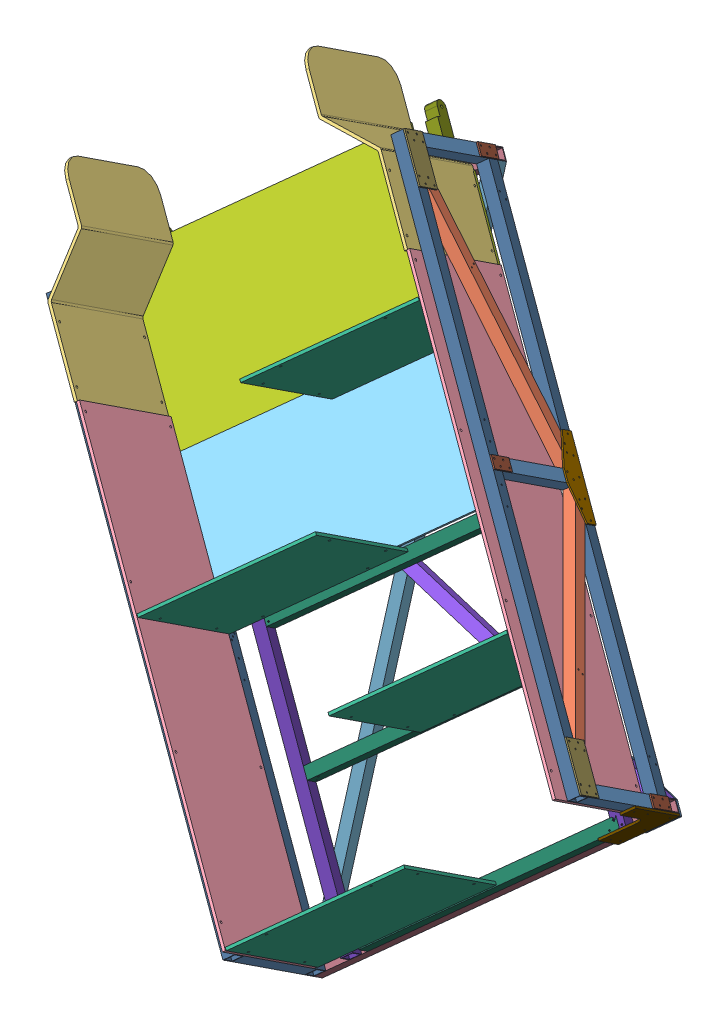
SolidWorks assembly FOCE Flue  Wing Assembly- JS.SLDASM, configuration Default (file format 3800). Lengths in mm.
Overall size (2968.73 2794.38 2015.12).
51 component instances, 22 part files, 117 mates.
Components (placement in the parent):
- UHMW Clevis-6: UHMW Clevis.SLDPRT [Default] at (1142.5369 -133.8955 -970.6957) x (0 0 -1) z (-1 0 0) (suppressed, hidden)
- UHMW Clevis-7: UHMW Clevis.SLDPRT [Default] at (1142.5369 -133.8955 -2097.6937) x (0 0 -1) z (-0.999767 0.02158 0) (suppressed, hidden)
- FRP 16.5 x  2in x 2in-1: FRP 16.5 x  2in x 2in.SLDPRT [Default] at (1659.5307 -2544.8351 -1318.5893) x (0.030538 0.555686 0.830831) z (0.716672 -0.591588 0.36933) size (419.1 50.8 50.8)
- FRP 16.5 x  2in x 2in-2: FRP 16.5 x  2in x 2in.SLDPRT [Default] at (840.3743 -1868.6503 -1740.7335) x (0.030538 0.555686 0.830831) z (0.716672 -0.591588 0.36933) size (419.1 50.8 50.8)
- FRP 16.5 x  2in x 2in-3: FRP 16.5 x  2in x 2in.SLDPRT [Default] at (21.2179 -1192.4654 -2162.8777) x (0.030538 0.555686 0.830831) z (0.716672 -0.591588 0.36933) size (419.1 50.8 50.8)
- FRP Diagonal 46.06 in-1: FRP Diagonal 46.06 in.SLDPRT [Default] at (-1214.1594 446.1713 -1809.1036) x (0.645281 -0.763903 0.008061) z (-0.696741 -0.584155 0.416311) size (1169.85 50.8 50.8)
- FRP Diagonal 46.06 in-3: FRP Diagonal 46.06 in.SLDPRT [Default] at (1902.4778 -3716.5861 860.5212) x (-0.669595 0.321481 -0.669547) z (0.696741 0.584155 -0.416311) size (1169.85 50.8 50.8)
- FRP Diagonal 46.06 in-4: FRP Diagonal 46.06 in.SLDPRT [Default] at (-2204.3654 -385.5671 -1216.713) x (0.645281 -0.763903 0.008061) z (-0.696741 -0.584155 0.416311) size (1169.85 50.8 50.8)
- flume side, joint-1: flume side, joint.SLDPRT [Default] at (251.2644 -1138.1194 -1559.5597) x (-0.716672 0.591588 -0.36933) z (0.696741 0.584155 -0.416311) size (795.53 525.78 198.63)
- flume side, joint-2: flume side, joint.SLDPRT [Default] at (-720.2957 -2228.8512 -1421.3998) x (-0.716672 0.591588 -0.36933) z (-0.696741 -0.584155 0.416311) size (795.53 525.78 198.63)
- test flume-1: test flume.SLDPRT [Default] at (1118.7791 354.4109 -2099.4399) x (-0.999767 0.02158 0) z (0 0 -1) (suppressed, hidden)
- flume side-1: flume side.SLDPRT [Default] at (677.8267 -3358.5627 -717.2036) x (0.696741 0.584155 -0.416311) z (0.716672 -0.591588 0.36933) size (12.7 525.78 1930.4)
- flume top OB-1: flume top OB.SLDPRT [Default] at (750.7573 -1846.1891 -1737.1763) x (-0.696741 -0.584155 0.416311) z (-0.716672 0.591588 -0.36933) (suppressed, hidden)
- flume mid-top -1: flume mid-top .SLDPRT [Default] at (322.8741 -1499.8684 -1947.3091) x (-0.696741 -0.584155 0.416311) z (-0.716672 0.591588 -0.36933) size (1371.6 12.7 608.33)
- flume baffle-1: flume baffle.SLDPRT [Default] at (-162.5392 -1958.1667 -1622.943) x (0.696741 0.584155 -0.416311) z (-0.030538 -0.555686 -0.830831) size (736.6 12.7 525.78)
- flume baffle-2: flume baffle.SLDPRT [Default] at (360.5228 -1940.0682 -1027.2073) x (-0.696741 -0.584155 0.416311) z (0.030538 0.555686 0.830831) size (736.6 12.7 525.78)
- flume baffle-3: flume baffle.SLDPRT [Default] at (1204.0684 -1926.8975 -1061.2522) x (-0.696741 -0.584155 0.416311) z (0.030538 0.555686 0.830831) size (736.6 12.7 525.78)
- flume baffle-4: flume baffle.SLDPRT [Default] at (668.5786 -3353.7131 -725.8765) x (0.696741 0.584155 -0.416311) z (-0.030538 -0.555686 -0.830831) size (736.6 12.7 525.78)
- flume top InB-1: flume top InB.SLDPRT [Default] at (322.8741 -1499.8684 -1947.3091) x (-0.716672 0.591588 -0.36933) z (0.696741 0.584155 -0.416311) size (698.5 12.7 1371.6)
- flume side-2: flume side.SLDPRT [Default] at (1631.6896 -2282.6684 -844.7892) x (-0.696741 -0.584155 0.416311) z (0.716672 -0.591588 0.36933) size (12.7 525.78 1930.4)
- Diagonal FRP 105.3945-1: Diagonal FRP 105.3945.SLDPRT [Default] at (1620.4348 -2571.5816 -1421.5505) x (-0.206066 -0.809863 0.549235) z (-0.978062 0.187978 -0.089776) size (50.8 50.8 2677.02)
- FRP Diagonal 46.06 in-6: FRP Diagonal 46.06 in.SLDPRT [Default] at (2894.3687 -2886.3824 268.7971) x (-0.669595 0.321481 -0.669547) z (0.696741 0.584155 -0.416311) size (1169.85 50.8 50.8)
- Wing Diagonal FRP Stiffening Plate-1: Wing Diagonal FRP Stiffening Plate.SLDPRT [Default] at (-187.9719 -2757.4351 -1170.1964) x (0.043884 0.544568 0.837568) z (0.715979 -0.601837 0.353788) size (101.6 6.35 330.2)
- FRP 16.5 x  2in x 2in-7: FRP 16.5 x  2in x 2in.SLDPRT [Default] at (-992.4302 -1820.2925 -1201.5731) x (-0.030538 -0.555686 -0.830831) z (0.716672 -0.591588 0.36933) size (419.1 50.8 50.8)
- FRP 16.5 x  2in x 2in-8: FRP 16.5 x  2in x 2in.SLDPRT [Default] at (-172.4275 -2497.1759 -778.9928) x (-0.030538 -0.555686 -0.830831) z (0.716672 -0.591588 0.36933) size (419.1 50.8 50.8)
- FRP 16.5 x  2in x 2in-10: FRP 16.5 x  2in x 2in.SLDPRT [Default] at (645.8903 -3172.5246 -357.079) x (-0.030538 -0.555686 -0.830831) z (0.716672 -0.591588 0.36933) size (419.1 50.8 50.8)
- FRP 92 x  2in x 2in -5: FRP 92 x  2in x 2in .SLDPRT [Default] at (1636.9349 -2341.6223 -949.2392) x (-0.716672 0.591588 -0.36933) z (-0.030538 -0.555686 -0.830831) size (2336.8 50.8 50.8)
- FRP 92 x  2in x 2in -6: FRP 92 x  2in x 2in .SLDPRT [Default] at (682.8285 -3114.7583 -336.2271) x (-0.716672 0.591588 -0.36933) z (0.030538 0.555686 0.830831) size (2336.8 50.8 50.8)
- FRP 92 x  2in x 2in -7: FRP 92 x  2in x 2in .SLDPRT [Default] at (668.4861 -3375.7374 -726.429) x (-0.716672 0.591588 -0.36933) z (0.030538 0.555686 0.830831) size (2336.8 50.8 50.8)
- FRP 92 x  2in x 2in -8: FRP 92 x  2in x 2in .SLDPRT [Default] at (-50.5836 -1192.0878 -2160.4911) x (0.716672 -0.591588 0.36933) z (0.030538 0.555686 0.830831) size (2336.8 50.8 50.8)
- Wing Diagonal FRP Stiffening Plate-2: Wing Diagonal FRP Stiffening Plate.SLDPRT [Default] at (802.4152 -1866.8258 -1801.7021) x (0.030538 0.555686 0.830831) z (-0.716672 0.591588 -0.36933) size (101.6 6.35 330.2)
- 2 in x 4 in  x .25 in FRP Stiffening Plate-1: 2 in x 4 in  x .25 in FRP Stiffening Plate.SLDPRT [Default] at (-9.2135 -1130.4745 -2142.077) x (-0.030538 -0.555686 -0.830831) z (-0.716672 0.591588 -0.36933) size (101.6 6.35 50.8) (hidden)
- 2 in x 6 in  x .25 in FRP WING Stiffening Plate-2: 2 in x 6 in  x .25 in FRP WING Stiffening Plate.SLDPRT [Default] at (-0.8392 -901.296 -1791.232) x (0.716672 -0.591588 0.36933) z (0.030538 0.555686 0.830831) size (203.2 6.35 101.6)
- 2 in x 6 in  x .25 in FRP WING Stiffening Plate-3: 2 in x 6 in  x .25 in FRP WING Stiffening Plate.SLDPRT [Default] at (1528.2529 -2163.5078 -1003.2294) x (0.716672 -0.591588 0.36933) z (0.030538 0.555686 0.830831) size (203.2 6.35 101.6)
- 2 in x 4 in  x .25 in FRP Stiffening Plate-3: 2 in x 4 in  x .25 in FRP Stiffening Plate.SLDPRT [Default] at (822.7416 -1573.7715 -1371.7313) x (-0.030538 -0.555686 -0.830831) z (-0.716672 0.591588 -0.36933) size (101.6 6.35 50.8)
- 2 in x 4 in  x .25 in FRP Stiffening Plate-4: 2 in x 4 in  x .25 in FRP Stiffening Plate.SLDPRT [Default] at (1629.0994 -2482.8442 -1297.7886) x (-0.030538 -0.555686 -0.830831) z (-0.716672 0.591588 -0.36933) size (101.6 6.35 50.8)
- FRP 58 x  2in x 2in-7: FRP 58 x  2in x 2in.SLDPRT [Default] at (1620.0211 -2571.2401 -1421.7637) x (-0.696741 -0.584155 0.416311) z (-0.716672 0.591588 -0.36933) size (1473.2 50.8 50.8)
- FRP 58 x  2in x 2in-8: FRP 58 x  2in x 2in.SLDPRT [Default] at (-18.2918 -1218.8704 -2266.0521) x (-0.696741 -0.584155 0.416311) z (-0.716672 0.591588 -0.36933) size (1473.2 50.8 50.8)
- Short Diagonal FRP for 105.3945-1: Short Diagonal FRP for 105.3945.SLDPRT [Default] at (595.1334 -3403.5887 -766.2487) x (0.971862 0.177725 -0.15459) z (-0.233562 0.812174 -0.534623) size (50.8 50.8 1322.11)
- Short Diagonal FRP for 105.3945-3: Short Diagonal FRP for 105.3945.SLDPRT [Default] at (19.4123 -1220.9074 -2204.932) x (-0.971862 -0.177725 0.15459) z (0.233562 -0.812174 0.534623) size (50.8 50.8 1322.11)
- FRP 42.4 x  2in x 2in-9: FRP 42.4 x  2in x 2in.SLDPRT [Default] at (787.2759 -3303.071 -840.5404) x (0.696741 0.584155 -0.416311) z (0.716672 -0.591588 0.36933) size (1076.2 50.8 50.8)
- FRP 42.4 x  2in x 2in-10: FRP 42.4 x  2in x 2in.SLDPRT [Default] at (-868.4732 -1965.3199 -1674.4105) x (0.696741 0.584155 -0.416311) z (0.716672 -0.591588 0.36933) size (1076.2 50.8 50.8)
- FRP 42.4 x  2in x 2in-11: FRP 42.4 x  2in x 2in.SLDPRT [Default] at (-49.3167 -2641.5048 -1252.2663) x (0.696741 0.584155 -0.416311) z (0.716672 -0.591588 0.36933) size (1076.2 50.8 50.8)
- FRP 42.4 x  2in x 2in-12: FRP 42.4 x  2in x 2in.SLDPRT [Default] at (-464.407 -2298.8623 -1466.179) x (0.696741 0.584155 -0.416311) z (0.716672 -0.591588 0.36933) size (1076.2 50.8 50.8)
- FRP 42.4 x  2in x 2in-13: FRP 42.4 x  2in x 2in.SLDPRT [Default] at (300.6939 -2930.4262 -1071.8918) x (0.696741 0.584155 -0.416311) z (-0.030538 -0.555686 -0.830831) size (1076.2 50.8 50.8)
- UHMW Clevis Pin-3: UHMW Clevis Pin.SLDPRT [Default] at (-292.7086 -1186.9104 -2203.6634) x (0.696741 0.584155 -0.416311) z (0.030538 0.555686 0.830831) size (50.8 311.15 65.53)
- FRP 93.3 x  2in x 2in-3: FRP 93.3 x  2in x 2in.SLDPRT [Default] at (1555.07 -2659.3443 -1299.306) x (-0.716672 0.591588 -0.36933) z (0.696741 0.584155 -0.416311) size (2370.58 50.8 50.8)
- FRP 93.3 x  2in x 2in-4: FRP 93.3 x  2in x 2in.SLDPRT [Default] at (769.8397 -3317.6897 -830.1221) x (-0.716672 0.591588 -0.36933) z (0.696741 0.584155 -0.416311) size (2370.58 50.8 50.8)
- UHMW Clevis Pin-5: UHMW Clevis Pin.SLDPRT [Default] at (-1077.9389 -1845.2558 -1734.4795) x (0.696741 0.584155 -0.416311) z (0.030538 0.555686 0.830831) size (50.8 311.15 65.53)
- wing entrance corner FRPsup't-1: wing entrance corner FRPsup't.SLDPRT [Default] at (1656.4281 -2601.2928 -1403.0017) x (-0.696741 -0.584155 0.416311) z (0.716672 -0.591588 0.36933) size (254 254 9.53)
- wing top entrance corner FRP sup't-1: wing top entrance corner FRP sup't.SLDPRT [Default] at (1663.2544 -2606.9277 -1399.4839) x (-0.696741 -0.584155 0.416311) z (-0.030538 -0.555686 -0.830831) size (146.05 294.05 9.53)
Mates (geometry in assembly coordinates):
- Distance57: distance = 1143 mm aligned: plane of FRP 16.5 x  2in x 2in-1 through (1672.3293 -2311.9472 -970.3878) normal (0.716672 -0.591588 0.36933); plane of FRP 16.5 x  2in x 2in-2 through (853.1729 -1635.7624 -1392.532) normal (0.716672 -0.591588 0.36933)
- Concentric190: concentric aligned: cylinder of UHMW Clevis-7; cylinder of UHMW Clevis-6
- Distance81: distance = 2.54 mm anti-aligned: plane of UHMW Clevis-7 through (1110.7943 -133.2103 -2199.2937) normal (-0.999767 0.02158 0); plane of test flume-1 through (1107.8164 -153.4708 -2099.4399) normal (0.999767 -0.02158 0)
- Distance82: distance = 22.86 mm aligned: plane of UHMW Clevis-7 through (1173.5093 -170.264 -2122.2999) normal (0 0 -1); plane of test flume-1 through (1107.8164 -153.4708 -2099.4399) normal (0 0 -1)
- Distance80: distance = 12.7 mm anti-aligned: plane of test flume-1 through (576.8976 -32.7653 -2086.744) normal (-0.02158 -0.999767 0); plane of UHMW Clevis-7 through (1187.8101 -33.2491 -2081.103) normal (0.02158 0.999767 0)
- Coincident833: coincident anti-aligned: plane of flume side-1 through (-714.4861 -2223.9804 -1424.8711) normal (-0.716672 0.591588 -0.36933); plane of flume side, joint-2 through (-704.2393 -1936.6827 -984.5653) normal (0.716672 -0.591588 0.36933)
- Coincident834: coincident aligned: plane of flume side-1 through (668.9781 -3365.9815 -711.9164) normal (-0.030538 -0.555686 -0.830831); plane of flume side, joint-2 through (-711.4471 -2221.4324 -1426.687) normal (-0.030538 -0.555686 -0.830831)
- Coincident840: coincident aligned: plane of ? through (684.9304 -3076.5118 -279.0429) normal (-0.696741 -0.584155 0.416311); plane of flume top OB-1 through (-205.2807 -2654.4736 -1176.7162) normal (-0.696741 -0.584155 0.416311)
- Coincident841: coincident anti-aligned: plane of flume top OB-1 through (750.3694 -1853.2463 -1747.7278) normal (-0.716672 0.591588 -0.36933); plane of ? through (750.3694 -1853.2463 -1747.7278) normal (0.716672 -0.591588 0.36933)
- Coincident843: coincident aligned: plane of flume side, joint-2 through (-704.2393 -1936.6827 -984.5653) normal (-0.696741 -0.584155 0.416311); plane of flume mid-top -1 through (-633.1639 -2308.1528 -1386.849) normal (-0.696741 -0.584155 0.416311)
- Coincident910: coincident anti-aligned: plane of flume side-1 through (693.8831 -3066.3943 -280.3691) normal (0.696741 0.584155 -0.416311); plane of flume baffle-4 through (677.6803 -3361.2263 -721.186) normal (-0.696741 -0.584155 0.416311)
- Coincident911: coincident aligned: plane of flume side-1 through (668.9781 -3365.9815 -711.9164) normal (0.716672 -0.591588 0.36933); plane of flume baffle-4 through (693.7367 -3069.0578 -284.3515) normal (0.716672 -0.591588 0.36933)
- Coincident912: coincident anti-aligned: plane of flume top OB-1 through (1624.5241 -2567.453 -1286.8891) normal (0.030538 0.555686 0.830831); plane of ? through (677.7226 -3361.2614 -721.1646) normal (-0.030538 -0.555686 -0.830831)
- Coincident913: coincident anti-aligned: plane of flume mid-top -1 through (758.8474 -1859.749 -1722.6345) normal (0.030538 0.555686 0.830831); plane of flume baffle-3 through (1197.1138 -2226.5791 -1493.3963) normal (-0.030538 -0.555686 -0.830831)
- Coincident915: coincident anti-aligned: plane of flume top OB-1 through (1624.5241 -2567.453 -1286.8891) normal (0.030538 0.555686 0.830831); plane of ? through (353.5822 -2239.7616 -1459.3442) normal (-0.030538 -0.555686 -0.830831)
- Coincident916: coincident anti-aligned: plane of flume mid-top -1 through (758.8474 -1859.749 -1722.6345) normal (0.030538 0.555686 0.830831); plane of flume baffle-1 through (-153.4375 -1965.6798 -1618.2525) normal (-0.030538 -0.555686 -0.830831)
- Coincident917: coincident anti-aligned: plane of flume side-1 through (693.8831 -3066.3943 -280.3691) normal (0.696741 0.584155 -0.416311); plane of flume baffle-2 through (-143.595 -2377.8701 -715.8624) normal (-0.696741 -0.584155 0.416311)
- Distance95: distance = 12.7 mm: plane of ? through (1213.052 -1937.0977 -1060.53) normal (0.696741 0.584155 -0.416311); line of flume top OB-1
- Distance96: distance = 584.2 mm: line of flume baffle-4; line of flume baffle-3
- Distance97: distance = 584.2 mm: line of flume baffle-3; line of flume baffle-2
- Distance99: distance = 584.2 mm: line of flume baffle-2; line of flume baffle-1
- Coincident920: coincident anti-aligned: plane of flume side, joint-2 through (-711.4471 -2221.4324 -1426.687) normal (-0.030538 -0.555686 -0.830831); plane of flume top InB-1 through (-632.776 -2301.0956 -1376.2974) normal (0.030538 0.555686 0.830831)
- Coincident923: coincident anti-aligned: plane of flume mid-top -1 through (322.4863 -1506.9256 -1957.8606) normal (-0.716672 0.591588 -0.36933); plane of flume top InB-1 through (322.4863 -1506.9256 -1957.8606) normal (0.716672 -0.591588 0.36933)
- Coincident927: coincident anti-aligned: plane of flume side-2 through (257.074 -1133.2485 -1563.031) normal (-0.716672 0.591588 -0.36933); plane of flume side, joint-1 through (235.208 -1430.2878 -1996.3943) normal (0.716672 -0.591588 0.36933)
- Coincident929: coincident anti-aligned: plane of flume baffle-3 through (1213.1702 -1934.4106 -1056.5617) normal (0.696741 0.584155 -0.416311); plane of flume side-2 through (1615.6332 -2574.8369 -1281.6238) normal (-0.696741 -0.584155 0.416311)
- Coincident968: coincident aligned: line of FRP Diagonal 46.06 in-1; line of FRP 16.5 x  2in x 2in-2
- Coincident1005: coincident aligned: plane of FRP 16.5 x  2in x 2in-7 through (-1005.2288 -2053.1803 -1549.7746) normal (-0.696741 -0.584155 0.416311); plane of FRP 16.5 x  2in x 2in-8 through (-185.2261 -2730.0637 -1127.1943) normal (-0.696741 -0.584155 0.416311)
- Concentric193: concentric aligned: cylinder of FRP 16.5 x  2in x 2in-8; cylinder of Wing Diagonal FRP Stiffening Plate-1
- Coincident1013: coincident aligned: plane of FRP 16.5 x  2in x 2in-3 through (34.0164 -959.5775 -1814.6762) normal (0.696741 0.584155 -0.416311); plane of FRP 92 x  2in x 2in -5 through (-2.3905 -929.5248 -1833.4382) normal (0.696741 0.584155 -0.416311)
- Coincident1014: coincident aligned: plane of FRP 16.5 x  2in x 2in-3 through (-2.3905 -929.5248 -1833.4382) normal (-0.716672 0.591588 -0.36933); plane of FRP 92 x  2in x 2in -5 through (-2.3905 -929.5248 -1833.4382) normal (-0.716672 0.591588 -0.36933)
- Coincident1017: coincident anti-aligned: plane of FRP 16.5 x  2in x 2in-3 through (-1.378 -989.2526 -1793.5277) normal (0.030538 0.555686 0.830831); plane of FRP 92 x  2in x 2in -5 through (-37.785 -959.1999 -1812.2896) normal (-0.030538 -0.555686 -0.830831)
- Coincident1018: coincident aligned: plane of FRP Diagonal 46.06 in-1 through (788.0511 -1852.5297 -1805.6821) normal (0.696741 0.584155 -0.416311); plane of FRP 92 x  2in x 2in -5 through (-2.3905 -929.5248 -1833.4382) normal (0.696741 0.584155 -0.416311)
- Coincident1019: coincident anti-aligned: plane of FRP Diagonal 46.06 in-6 through (1636.7686 -2282.5931 -988.7137) normal (0.030538 0.555686 0.830831); plane of FRP 92 x  2in x 2in -5 through (-37.785 -959.1999 -1812.2896) normal (-0.030538 -0.555686 -0.830831)
- Coincident1020: coincident aligned: plane of FRP Diagonal 46.06 in-6 through (853.4443 -1906.5095 -1771.9824) normal (0.696741 0.584155 -0.416311); plane of FRP 92 x  2in x 2in -5 through (-2.3905 -929.5248 -1833.4382) normal (0.696741 0.584155 -0.416311)
- Coincident1024: coincident anti-aligned: line of FRP Diagonal 46.06 in-4; line of FRP 16.5 x  2in x 2in-8
- Coincident1025: coincident: point of FRP Diagonal 46.06 in-4; point of FRP 16.5 x  2in x 2in-7
- Coincident1027: coincident: point of FRP Diagonal 46.06 in-3; point of FRP 16.5 x  2in x 2in-10
- Coincident1031: coincident aligned: plane of flume side-1 through (668.9781 -3365.9815 -711.9164) normal (0.716672 -0.591588 0.36933); plane of flume side-2 through (1640.5382 -2275.2497 -850.0764) normal (0.716672 -0.591588 0.36933)
- Coincident1034: coincident aligned: plane of FRP 16.5 x  2in x 2in-7 through (-1041.6357 -2023.1277 -1568.5365) normal (-0.716672 0.591588 -0.36933); plane of FRP 92 x  2in x 2in -6 through (-1027.2858 -1762.011 -1178.1289) normal (-0.716672 0.591588 -0.36933)
- Coincident1035: coincident anti-aligned: plane of FRP 16.5 x  2in x 2in-7 through (-957.0357 -1790.6174 -1222.7217) normal (0.030538 0.555686 0.830831); plane of FRP 92 x  2in x 2in -6 through (-993.4427 -1760.5647 -1241.4837) normal (-0.030538 -0.555686 -0.830831)
- Coincident1036: coincident aligned: plane of FRP 92 x  2in x 2in -6 through (-1027.2858 -1762.011 -1178.1289) normal (-0.696741 -0.584155 0.416311); plane of FRP 92 x  2in x 2in -7 through (-1041.6282 -2022.9901 -1568.3308) normal (-0.696741 -0.584155 0.416311)
- Coincident1037: coincident: line of FRP 92 x  2in x 2in -6; plane of FRP 92 x  2in x 2in -7 through (-1041.6282 -2022.9901 -1568.3308) normal (-0.716672 0.591588 -0.36933)
- Coincident1043: coincident anti-aligned: plane of FRP 92 x  2in x 2in -8 through (1659.5307 -2544.8351 -1318.5893) normal (0.696741 0.584155 -0.416311); plane of Wing Diagonal FRP Stiffening Plate-2 through (702.2961 -1784.181 -1853.2975) normal (-0.696741 -0.584155 0.416311)
- Coincident1051: coincident aligned: plane of flume top OB-1 through (1624.1363 -2574.5102 -1297.4407) normal (-0.030538 -0.555686 -0.830831); plane of ? through (-641.254 -2294.5929 -1401.3907) normal (-0.030538 -0.555686 -0.830831)
- Coincident1057: coincident anti-aligned: plane of FRP 16.5 x  2in x 2in-10 through (668.4861 -3375.7374 -726.429) normal (-0.030538 -0.555686 -0.830831); plane of FRP 92 x  2in x 2in -7 through (-1006.2337 -1993.315 -1589.4794) normal (0.030538 0.555686 0.830831)
- Concentric202: concentric aligned: cylinder of Wing Diagonal FRP Stiffening Plate-1; cylinder of FRP 92 x  2in x 2in -7
- Coincident1059: coincident aligned: plane of FRP 16.5 x  2in x 2in-10 through (633.0917 -3405.4125 -705.2805) normal (0.716672 -0.591588 0.36933); plane of FRP 92 x  2in x 2in -6 through (647.4341 -3144.4334 -315.0785) normal (0.716672 -0.591588 0.36933)
- Parallel20: parallel aligned: plane of FRP 92 x  2in x 2in -8 through (1622.585 -2602.739 -1339.6469) normal (-0.030538 -0.555686 -0.830831); plane of 2 in x 4 in  x .25 in FRP Stiffening Plate-1 through (-16.7404 -1190.6416 -2223.8459) normal (-0.030538 -0.555686 -0.830831)
- Coincident1063: coincident anti-aligned: plane of FRP 16.5 x  2in x 2in-8 through (-137.0331 -2467.5008 -800.1414) normal (0.030538 0.555686 0.830831); plane of FRP 92 x  2in x 2in -6 through (-993.4427 -1760.5647 -1241.4837) normal (-0.030538 -0.555686 -0.830831)
- Coincident1064: coincident anti-aligned: plane of Wing Diagonal FRP Stiffening Plate-1 through (-87.9496 -2841.5117 -1120.7722) normal (0.696741 0.584155 -0.416311); plane of FRP 92 x  2in x 2in -7 through (-1041.6282 -2022.9901 -1568.3308) normal (-0.696741 -0.584155 0.416311)
- Concentric203: concentric anti-aligned: cylinder of FRP 92 x  2in x 2in -5; cylinder of 2 in x 6 in  x .25 in FRP WING Stiffening Plate-2
- Concentric204: concentric anti-aligned: cylinder of FRP 92 x  2in x 2in -5; cylinder of 2 in x 6 in  x .25 in FRP WING Stiffening Plate-2
- Coincident1067: coincident anti-aligned: plane of FRP 16.5 x  2in x 2in-1 through (1624.1363 -2574.5102 -1297.4407) normal (-0.030538 -0.555686 -0.830831); plane of FRP 92 x  2in x 2in -8 through (1624.1363 -2574.5102 -1297.4407) normal (0.030538 0.555686 0.830831)
- Coincident1068: coincident aligned: plane of FRP 16.5 x  2in x 2in-1 through (1672.3293 -2311.9472 -970.3878) normal (0.696741 0.584155 -0.416311); plane of FRP 92 x  2in x 2in -8 through (1659.5307 -2544.8351 -1318.5893) normal (0.696741 0.584155 -0.416311)
- Coincident1072: coincident anti-aligned: plane of FRP 16.5 x  2in x 2in-10 through (668.4861 -3375.7374 -726.429) normal (-0.030538 -0.555686 -0.830831); plane of FRP 92 x  2in x 2in -7 through (-1006.2337 -1993.315 -1589.4794) normal (0.030538 0.555686 0.830831)
- Coincident1075: coincident aligned: plane of FRP 92 x  2in x 2in -6 through (-1027.2858 -1762.011 -1178.1289) normal (-0.696741 -0.584155 0.416311); plane of FRP 92 x  2in x 2in -7 through (-1041.6282 -2022.9901 -1568.3308) normal (-0.696741 -0.584155 0.416311)
- Coincident1076: coincident aligned: plane of FRP 16.5 x  2in x 2in-10 through (633.0917 -3405.4125 -705.2805) normal (-0.696741 -0.584155 0.416311); plane of FRP 92 x  2in x 2in -6 through (-1027.2858 -1762.011 -1178.1289) normal (-0.696741 -0.584155 0.416311)
- Coincident1077: coincident: plane of FRP 16.5 x  2in x 2in-7 through (-1041.6357 -2023.1277 -1568.5365) normal (-0.716672 0.591588 -0.36933); point of FRP 92 x  2in x 2in -6
- Coincident1078: coincident aligned: plane of FRP 16.5 x  2in x 2in-7 through (-1005.2288 -2053.1803 -1549.7746) normal (-0.696741 -0.584155 0.416311); plane of FRP 92 x  2in x 2in -6 through (-1027.2858 -1762.011 -1178.1289) normal (-0.696741 -0.584155 0.416311)
- Coincident1079: coincident anti-aligned: plane of FRP Diagonal 46.06 in-3 through (-151.5165 -2698.854 -1149.0093) normal (-0.030538 -0.555686 -0.830831); plane of FRP 92 x  2in x 2in -7 through (-1006.2337 -1993.315 -1589.4794) normal (0.030538 0.555686 0.830831)
- Coincident1081: coincident anti-aligned: plane of FRP Diagonal 46.06 in-1 through (-2.2242 -988.5541 -1793.9637) normal (0.030538 0.555686 0.830831); plane of FRP 92 x  2in x 2in -5 through (-37.785 -959.1999 -1812.2896) normal (-0.030538 -0.555686 -0.830831)
- Coincident1083: coincident aligned: line of FRP 16.5 x  2in x 2in-2; line of FRP Diagonal 46.06 in-6
- Coincident1084: coincident anti-aligned: plane of FRP Diagonal 46.06 in-6 through (840.3743 -1868.6503 -1740.7335) normal (-0.030538 -0.555686 -0.830831); plane of FRP 92 x  2in x 2in -8 through (1624.1363 -2574.5102 -1297.4407) normal (0.030538 0.555686 0.830831)
- Concentric205: concentric aligned: cylinder of FRP 16.5 x  2in x 2in-1; cylinder of 2 in x 6 in  x .25 in FRP WING Stiffening Plate-3
- Coincident1085: coincident anti-aligned: plane of FRP 92 x  2in x 2in -5 through (-2.3905 -929.5248 -1833.4382) normal (0.696741 0.584155 -0.416311); plane of 2 in x 6 in  x .25 in FRP WING Stiffening Plate-3 through (1528.2529 -2163.5078 -1003.2294) normal (-0.696741 -0.584155 0.416311)
- Coincident1089: coincident anti-aligned: plane of FRP 92 x  2in x 2in -5 through (-2.3905 -929.5248 -1833.4382) normal (0.696741 0.584155 -0.416311); plane of 2 in x 4 in  x .25 in FRP Stiffening Plate-3 through (854.7242 -1607.5335 -1350.3258) normal (-0.696741 -0.584155 0.416311)
- Coincident1090: coincident aligned: plane of 2 in x 6 in  x .25 in FRP WING Stiffening Plate-3 through (1532.6772 -2159.7984 -1005.873) normal (0.696741 0.584155 -0.416311); plane of 2 in x 4 in  x .25 in FRP Stiffening Plate-4 through (1665.5064 -2512.8969 -1279.0266) normal (0.696741 0.584155 -0.416311)
- Coincident1091: coincident aligned: cylinder of 2 in x 4 in  x .25 in FRP Stiffening Plate-4; circle of FRP 92 x  2in x 2in -8
- Coincident1096: coincident aligned: line of flume top OB-1; line of ?
- Coincident1097: coincident aligned: line of flume mid-top -1; line of flume top InB-1
- Coincident1098: coincident aligned: plane of flume side, joint-1 through (235.208 -1430.2878 -1996.3943) normal (0.696741 0.584155 -0.416311); plane of flume top InB-1 through (322.4863 -1506.9256 -1957.8606) normal (0.696741 0.584155 -0.416311)
- Coincident1099: coincident aligned: plane of flume side, joint-1 through (235.208 -1430.2878 -1996.3943) normal (0.696741 0.584155 -0.416311); plane of flume top InB-1 through (322.4863 -1506.9256 -1957.8606) normal (0.696741 0.584155 -0.416311)
- Coincident1175: coincident anti-aligned: plane of flume top OB-1 through (-205.2807 -2654.4736 -1176.7162) normal (-0.696741 -0.584155 0.416311); plane of FRP 92 x  2in x 2in -7 through (-1006.2337 -1993.315 -1589.4794) normal (0.696741 0.584155 -0.416311)
- Coincident1101: coincident anti-aligned: plane of FRP Diagonal 46.06 in-1 through (788.0511 -1852.5297 -1805.6821) normal (0.696741 0.584155 -0.416311); plane of 2 in x 6 in  x .25 in FRP WING Stiffening Plate-2 through (-0.8392 -901.296 -1791.232) normal (-0.696741 -0.584155 0.416311)
- Coincident1109: coincident aligned: plane of FRP 92 x  2in x 2in -7 through (-1041.6282 -2022.9901 -1568.3308) normal (-0.716672 0.591588 -0.36933); plane of FRP 58 x  2in x 2in-8 through (-1044.7308 -2079.4478 -1652.7433) normal (-0.716672 0.591588 -0.36933)
- Coincident1111: coincident anti-aligned: plane of Diagonal FRP 105.3945-1 through (-1006.7725 -2081.2716 -1591.7751) normal (-0.716672 0.591588 -0.36933); plane of FRP 58 x  2in x 2in-8 through (-1008.3239 -2109.5004 -1633.9813) normal (0.716672 -0.591588 0.36933)
- Coincident1112: coincident aligned: plane of Diagonal FRP 105.3945-1 through (-997.8558 -2068.3594 -1661.8825) normal (-0.030538 -0.555686 -0.830831); plane of FRP 58 x  2in x 2in-8 through (-1044.7308 -2079.4478 -1652.7433) normal (-0.030538 -0.555686 -0.830831)
- Coincident1113: coincident: point of Diagonal FRP 105.3945-1; point of FRP 58 x  2in x 2in-8
- Coincident1119: coincident anti-aligned: plane of FRP 92 x  2in x 2in -8 through (1622.585 -2602.739 -1339.6469) normal (-0.030538 -0.555686 -0.830831); plane of FRP 58 x  2in x 2in-8 through (-1043.1795 -2051.2189 -1610.5371) normal (0.030538 0.555686 0.830831)
- Coincident1120: coincident: point of 2 in x 4 in  x .25 in FRP Stiffening Plate-1; point of FRP 58 x  2in x 2in-8
- Coincident1121: coincident: point of FRP 92 x  2in x 2in -8; point of FRP 58 x  2in x 2in-7
- Coincident1122: coincident aligned: plane of Diagonal FRP 105.3945-1 through (-997.8558 -2068.3594 -1661.8825) normal (-0.030538 -0.555686 -0.830831); plane of Short Diagonal FRP for 105.3945-1 through (-31.6692 -1257.6099 -2239.6502) normal (-0.030538 -0.555686 -0.830831)
- Coincident1125: coincident anti-aligned: plane of FRP 58 x  2in x 2in-7 through (593.5821 -3431.8175 -808.4549) normal (-0.716672 0.591588 -0.36933); plane of Short Diagonal FRP for 105.3945-1 through (593.5821 -3431.8175 -808.4549) normal (0.716672 -0.591588 0.36933)
- Coincident1127: coincident: point of FRP 58 x  2in x 2in-7; point of Short Diagonal FRP for 105.3945-1
- Coincident1131: coincident aligned: plane of Diagonal FRP 105.3945-1 through (-997.8558 -2068.3594 -1661.8825) normal (-0.030538 -0.555686 -0.830831); plane of Short Diagonal FRP for 105.3945-3 through (643.1122 -3423.3438 -815.9429) normal (-0.030538 -0.555686 -0.830831)
- Coincident1132: coincident aligned: plane of Short Diagonal FRP for 105.3945-1 through (-30.1178 -1229.3811 -2197.444) normal (-0.971862 -0.177725 0.15459); plane of Short Diagonal FRP for 105.3945-3 through (595.2929 -3404.1433 -765.8835) normal (-0.971862 -0.177725 0.15459)
- Coincident1133: coincident anti-aligned: plane of Diagonal FRP 105.3945-1 through (-997.8558 -2068.3594 -1661.8825) normal (0.206066 0.809863 -0.549235); plane of Short Diagonal FRP for 105.3945-3 through (167.3971 -2263.7881 -1512.8605) normal (-0.206066 -0.809863 0.549235)
- Coincident1139: coincident aligned: plane of FRP 42.4 x  2in x 2in-11 through (702.0661 -1984.6093 -1658.0927) normal (0.696741 0.584155 -0.416311); plane of FRP 42.4 x  2in x 2in-12 through (286.9757 -1641.9669 -1872.0055) normal (0.696741 0.584155 -0.416311)
- Coincident1140: coincident aligned: plane of FRP 42.4 x  2in x 2in-10 through (-117.0904 -1308.4245 -2080.237) normal (0.696741 0.584155 -0.416311); plane of FRP 42.4 x  2in x 2in-11 through (702.0661 -1984.6093 -1658.0927) normal (0.696741 0.584155 -0.416311)
- Coincident1151: coincident aligned: plane of FRP 58 x  2in x 2in-8 through (-1044.7308 -2079.4478 -1652.7433) normal (-0.716672 0.591588 -0.36933); plane of FRP 42.4 x  2in x 2in-10 through (-155.0487 -1306.6006 -2141.2052) normal (-0.716672 0.591588 -0.36933)
- Distance103: distance = 1143 mm aligned: plane of FRP 42.4 x  2in x 2in-11 through (664.1078 -1982.7855 -1719.0609) normal (-0.716672 0.591588 -0.36933); plane of FRP 42.4 x  2in x 2in-9 through (1500.7004 -2644.3517 -1307.3351) normal (-0.716672 0.591588 -0.36933)
- Coincident1157: coincident anti-aligned: plane of FRP 92 x  2in x 2in -7 through (-1007.785 -2021.5439 -1631.6857) normal (-0.030538 -0.555686 -0.830831); plane of Short Diagonal FRP for 105.3945-1 through (-30.1178 -1229.3811 -2197.444) normal (0.030538 0.555686 0.830831)
- Coincident1159: coincident aligned: plane of UHMW Clevis Pin-3 through (-292.7086 -1186.9104 -2203.6634) normal (-0.696741 -0.584155 0.416311); plane of FRP 93.3 x  2in x 2in-3 through (-179.2549 -1286.6119 -2153.6845) normal (-0.696741 -0.584155 0.416311)
- Coincident1161: coincident anti-aligned: plane of UHMW Clevis Pin-3 through (-177.7113 -1258.5242 -2111.6893) normal (0.716672 -0.591588 0.36933); plane of FRP 93.3 x  2in x 2in-3 through (-142.3091 -1228.708 -2132.6269) normal (-0.716672 0.591588 -0.36933)
- Distance104: distance = 0.1524 mm anti-aligned: plane of UHMW Clevis Pin-3 through (-85.6435 -1357.5492 -2105.0945) normal (-0.030538 -0.555686 -0.830831); plane of FRP 93.3 x  2in x 2in-3 through (-146.2971 -1257.041 -2170.2715) normal (0.030538 0.555686 0.830831)
- Coincident1165: coincident anti-aligned: plane of FRP 93.3 x  2in x 2in-4 through (-927.5394 -1887.0534 -1663.443) normal (-0.716672 0.591588 -0.36933); plane of UHMW Clevis Pin-5 through (-962.9416 -1916.8696 -1642.5054) normal (0.716672 -0.591588 0.36933)
- Distance105: distance = 0.1524 mm anti-aligned: plane of UHMW Clevis Pin-5 through (-870.8738 -2015.8946 -1635.9107) normal (-0.030538 -0.555686 -0.830831); plane of FRP 93.3 x  2in x 2in-4 through (-931.5274 -1915.3864 -1701.0877) normal (0.030538 0.555686 0.830831)
- Coincident1168: coincident aligned: plane of FRP 93.3 x  2in x 2in-4 through (-964.4852 -1944.9573 -1684.5006) normal (-0.696741 -0.584155 0.416311); plane of UHMW Clevis Pin-5 through (-1077.9389 -1845.2558 -1734.4795) normal (-0.696741 -0.584155 0.416311)
- Coincident1170: coincident anti-aligned: plane of FRP 58 x  2in x 2in-8 through (-1043.1795 -2051.2189 -1610.5371) normal (0.030538 0.555686 0.830831); plane of FRP 93.3 x  2in x 2in-3 through (-143.8604 -1256.9368 -2174.8331) normal (-0.030538 -0.555686 -0.830831)
- Coincident1171: coincident anti-aligned: plane of FRP 58 x  2in x 2in-8 through (-1043.1795 -2051.2189 -1610.5371) normal (0.030538 0.555686 0.830831); plane of FRP 93.3 x  2in x 2in-4 through (-929.0907 -1915.2822 -1705.6492) normal (-0.030538 -0.555686 -0.830831)
- Coincident1173: coincident aligned: plane of UHMW Clevis Pin-3 through (-264.1778 -1187.1492 -2156.249) normal (-0.716672 0.591588 -0.36933); plane of UHMW Clevis Pin-5 through (-1049.4081 -1845.4946 -1687.0651) normal (-0.716672 0.591588 -0.36933)
- Coincident1174: coincident aligned: plane of FRP 92 x  2in x 2in -7 through (633.0917 -3405.4125 -705.2805) normal (0.716672 -0.591588 0.36933); plane of FRP 93.3 x  2in x 2in-4 through (771.3911 -3289.4608 -787.9159) normal (0.716672 -0.591588 0.36933)
- Distance106: distance = 1076.2043 mm anti-aligned: plane of UHMW Clevis Pin-5 through (-1068.8993 -1808.5804 -1789.9132) normal (0.696741 0.584155 -0.416311); plane of UHMW Clevis Pin-3 through (-292.7086 -1186.9104 -2203.6634) normal (-0.696741 -0.584155 0.416311)
- Distance107: distance = 147.6947 mm aligned: plane of FRP 93.3 x  2in x 2in-4 through (-964.4852 -1944.9573 -1684.5006) normal (-0.696741 -0.584155 0.416311); plane of FRP 92 x  2in x 2in -7 through (-1041.6282 -2022.9901 -1568.3308) normal (-0.696741 -0.584155 0.416311)
- Coincident1176: coincident anti-aligned: plane of FRP 16.5 x  2in x 2in-3 through (-1.378 -989.2526 -1793.5277) normal (-0.696741 -0.584155 0.416311); plane of flume side-2 through (1624.4818 -2567.4181 -1286.9109) normal (0.696741 0.584155 -0.416311)
- Coincident1177: coincident aligned: plane of FRP 16.5 x  2in x 2in-3 through (34.0164 -959.5775 -1814.6762) normal (0.696741 0.584155 -0.416311); plane of FRP 92 x  2in x 2in -8 through (1659.5307 -2544.8351 -1318.5893) normal (0.696741 0.584155 -0.416311)
- Coincident1178: coincident aligned: plane of FRP 16.5 x  2in x 2in-2 through (853.1729 -1635.7624 -1392.532) normal (0.696741 0.584155 -0.416311); plane of FRP 92 x  2in x 2in -5 through (-2.3905 -929.5248 -1833.4382) normal (0.696741 0.584155 -0.416311)
- Coincident1179: coincident aligned: plane of FRP 16.5 x  2in x 2in-7 through (-1005.2288 -2053.1803 -1549.7746) normal (-0.696741 -0.584155 0.416311); plane of FRP 58 x  2in x 2in-8 through (-1043.1795 -2051.2189 -1610.5371) normal (-0.696741 -0.584155 0.416311)
- Coincident1181: coincident anti-aligned: plane of FRP 16.5 x  2in x 2in-1 through (1672.3293 -2311.9472 -970.3878) normal (0.716672 -0.591588 0.36933); plane of wing entrance corner FRPsup't-1 through (1656.4281 -2601.2928 -1403.0017) normal (-0.716672 0.591588 -0.36933)
- Coincident1182: coincident aligned: plane of FRP 16.5 x  2in x 2in-1 through (1672.3293 -2311.9472 -970.3878) normal (0.716672 -0.591588 0.36933); plane of FRP 58 x  2in x 2in-7 through (629.989 -3461.8702 -789.6929) normal (0.716672 -0.591588 0.36933)
- Coincident1183: coincident aligned: plane of FRP 58 x  2in x 2in-7 through (593.5821 -3431.8175 -808.4549) normal (-0.030538 -0.555686 -0.830831); plane of wing entrance corner FRPsup't-1 through (1663.2544 -2606.9277 -1399.4839) normal (-0.030538 -0.555686 -0.830831)
- Coincident1184: coincident aligned: plane of FRP 16.5 x  2in x 2in-1 through (1672.3293 -2311.9472 -970.3878) normal (0.696741 0.584155 -0.416311); plane of wing entrance corner FRPsup't-1 through (1671.0111 -2465.7835 -1188.4527) normal (0.696741 0.584155 -0.416311)
- Coincident1185: coincident anti-aligned: plane of wing top entrance corner FRP sup't-1 through (1663.2544 -2606.9277 -1399.4839) normal (0.030538 0.555686 0.830831); plane of Diagonal FRP 105.3945-1 through (-997.8558 -2068.3594 -1661.8825) normal (-0.030538 -0.555686 -0.830831)
- Coincident1186: coincident aligned: plane of FRP 58 x  2in x 2in-7 through (1621.5724 -2543.0113 -1379.5575) normal (0.696741 0.584155 -0.416311); plane of wing top entrance corner FRP sup't-1 through (1662.9635 -2612.2206 -1407.3975) normal (0.696741 0.584155 -0.416311)
- Coincident1187: coincident aligned: plane of wing entrance corner FRPsup't-1 through (1663.2544 -2606.9277 -1399.4839) normal (0.716672 -0.591588 0.36933); plane of wing top entrance corner FRP sup't-1 through (1561.2044 -2697.5364 -1346.5954) normal (0.716672 -0.591588 0.36933)
- Coincident1188: coincident anti-aligned: plane of FRP 42.4 x  2in x 2in-13 through (337.1008 -2960.4789 -1053.1299) normal (-0.696741 -0.584155 0.416311); plane of FRP 93.3 x  2in x 2in-4 through (-929.0907 -1915.2822 -1705.6492) normal (0.696741 0.584155 -0.416311)
- Coincident1189: coincident anti-aligned: plane of FRP 42.4 x  2in x 2in-11 through (-47.7654 -2613.276 -1210.0601) normal (-0.696741 -0.584155 0.416311); plane of FRP 93.3 x  2in x 2in-4 through (-929.0907 -1915.2822 -1705.6492) normal (0.696741 0.584155 -0.416311)
